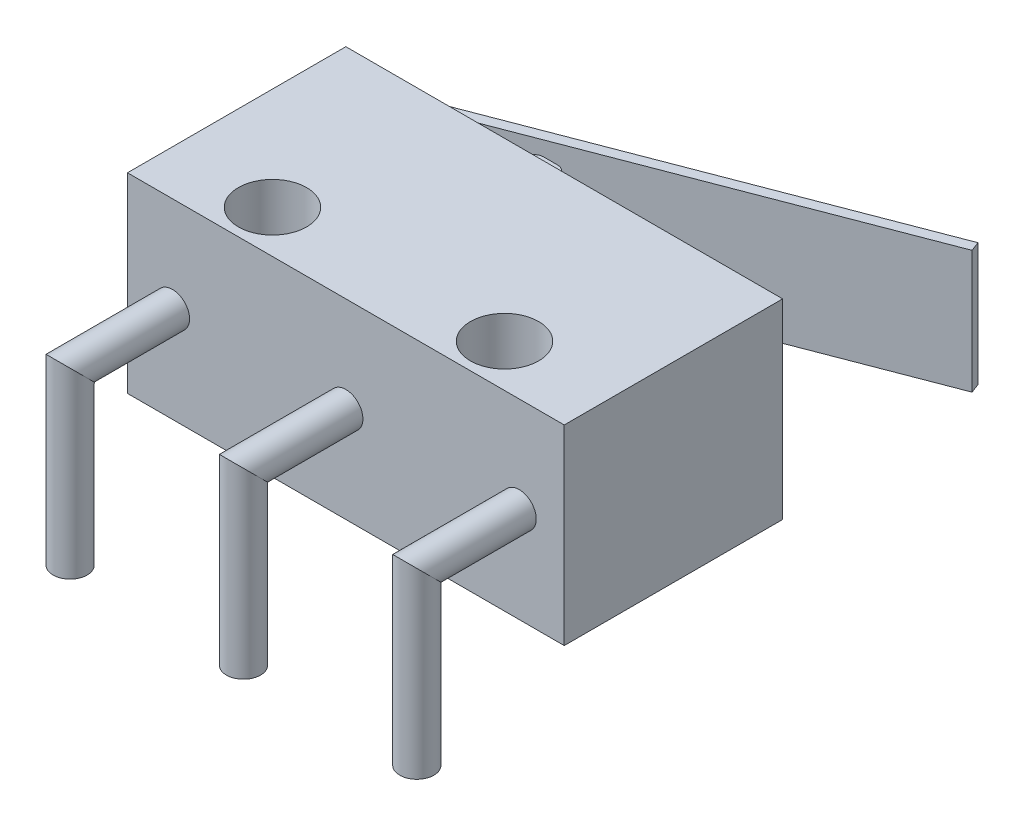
ISO-10303-21;
HEADER;
FILE_DESCRIPTION(('STEP AP214'),'2;1');
FILE_NAME('part.step','',(''),(''),'','','');
FILE_SCHEMA(('AUTOMOTIVE_DESIGN { 1 0 10303 214 1 1 1 1 }'));
ENDSEC;
DATA;
#1=APPLICATION_CONTEXT('core data for automotive mechanical design processes');
#2=APPLICATION_PROTOCOL_DEFINITION('international standard','automotive_design',2000,#1);
#3=PRODUCT_CONTEXT('',#1,'mechanical');
#4=PRODUCT('Part','Part','',(#3));
#5=PRODUCT_RELATED_PRODUCT_CATEGORY('part','',(#4));
#6=PRODUCT_DEFINITION_FORMATION('','',#4);
#7=PRODUCT_DEFINITION_CONTEXT('part definition',#1,'design');
#8=PRODUCT_DEFINITION('design','',#6,#7);
#9=PRODUCT_DEFINITION_SHAPE('','',#8);
#10=(LENGTH_UNIT() NAMED_UNIT(*) SI_UNIT(.MILLI.,.METRE.));
#11=(NAMED_UNIT(*) PLANE_ANGLE_UNIT() SI_UNIT($,.RADIAN.));
#12=(NAMED_UNIT(*) SI_UNIT($,.STERADIAN.) SOLID_ANGLE_UNIT());
#13=UNCERTAINTY_MEASURE_WITH_UNIT(LENGTH_MEASURE(1.E-05),#10,'distance_accuracy_value','');
#14=(GEOMETRIC_REPRESENTATION_CONTEXT(3) GLOBAL_UNCERTAINTY_ASSIGNED_CONTEXT((#13)) GLOBAL_UNIT_ASSIGNED_CONTEXT((#10,
#11,#12)) REPRESENTATION_CONTEXT('',''));
#15=CARTESIAN_POINT('',(0.,0.,0.));
#16=DIRECTION('',(0.,0.,1.));
#17=DIRECTION('',(1.,0.,0.));
#18=AXIS2_PLACEMENT_3D('',#15,#16,#17);
#19=CARTESIAN_POINT('',(0.,5.6,0.));
#20=DIRECTION('',(0.,0.,-1.));
#21=DIRECTION('',(-1.,0.,0.));
#22=AXIS2_PLACEMENT_3D('',#19,#20,#21);
#23=PLANE('',#22);
#24=CARTESIAN_POINT('',(1.32,2.8,0.));
#25=DIRECTION('',(0.,0.,1.));
#26=DIRECTION('',(1.,0.,0.));
#27=AXIS2_PLACEMENT_3D('',#24,#25,#26);
#28=CIRCLE('',#27,0.5);
#29=CARTESIAN_POINT('',(1.82,2.8,0.));
#30=VERTEX_POINT('',#29);
#31=EDGE_CURVE('E45',#30,#30,#28,.T.);
#32=ORIENTED_EDGE('',*,*,#31,.F.);
#33=EDGE_LOOP('',(#32));
#34=FACE_BOUND('',#33,.T.);
#35=DIRECTION('',(1.,0.,0.));
#36=VECTOR('',#35,1.);
#37=CARTESIAN_POINT('',(0.,0.,0.));
#38=LINE('',#37,#36);
#39=CARTESIAN_POINT('',(0.,0.,0.));
#40=VERTEX_POINT('',#39);
#41=CARTESIAN_POINT('',(12.8,0.,0.));
#42=VERTEX_POINT('',#41);
#43=EDGE_CURVE('E269',#40,#42,#38,.T.);
#44=ORIENTED_EDGE('',*,*,#43,.T.);
#45=DIRECTION('',(0.,-1.,0.));
#46=VECTOR('',#45,1.);
#47=CARTESIAN_POINT('',(12.8,5.6,0.));
#48=LINE('',#47,#46);
#49=CARTESIAN_POINT('',(12.8,5.6,0.));
#50=VERTEX_POINT('',#49);
#51=EDGE_CURVE('E290',#50,#42,#48,.T.);
#52=ORIENTED_EDGE('',*,*,#51,.F.);
#53=DIRECTION('',(1.,0.,0.));
#54=VECTOR('',#53,1.);
#55=CARTESIAN_POINT('',(0.,5.6,0.));
#56=LINE('',#55,#54);
#57=CARTESIAN_POINT('',(0.,5.6,0.));
#58=VERTEX_POINT('',#57);
#59=EDGE_CURVE('E278',#58,#50,#56,.T.);
#60=ORIENTED_EDGE('',*,*,#59,.F.);
#61=DIRECTION('',(0.,-1.,0.));
#62=VECTOR('',#61,1.);
#63=CARTESIAN_POINT('',(0.,5.6,0.));
#64=LINE('',#63,#62);
#65=EDGE_CURVE('E293',#58,#40,#64,.T.);
#66=ORIENTED_EDGE('',*,*,#65,.T.);
#67=EDGE_LOOP('',(#44,#52,#60,#66));
#68=FACE_BOUND('',#67,.T.);
#69=CARTESIAN_POINT('',(6.4,2.8,0.));
#70=DIRECTION('',(0.,0.,1.));
#71=DIRECTION('',(1.,0.,0.));
#72=AXIS2_PLACEMENT_3D('',#69,#70,#71);
#73=CIRCLE('',#72,0.500000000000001);
#74=CARTESIAN_POINT('',(6.9,2.8,0.));
#75=VERTEX_POINT('',#74);
#76=EDGE_CURVE('E314',#75,#75,#73,.T.);
#77=ORIENTED_EDGE('',*,*,#76,.F.);
#78=EDGE_LOOP('',(#77));
#79=FACE_BOUND('',#78,.T.);
#80=CARTESIAN_POINT('',(11.48,2.8,0.));
#81=DIRECTION('',(0.,0.,1.));
#82=DIRECTION('',(-1.,0.,0.));
#83=AXIS2_PLACEMENT_3D('',#80,#81,#82);
#84=CIRCLE('',#83,0.499999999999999);
#85=CARTESIAN_POINT('',(10.98,2.8,0.));
#86=VERTEX_POINT('',#85);
#87=EDGE_CURVE('E12',#86,#86,#84,.T.);
#88=ORIENTED_EDGE('',*,*,#87,.F.);
#89=EDGE_LOOP('',(#88));
#90=FACE_BOUND('',#89,.T.);
#91=ADVANCED_FACE('F36',(#34,#68,#79,#90),#23,.F.);
#92=CARTESIAN_POINT('',(0.,5.6,-6.4));
#93=DIRECTION('',(0.,0.,1.));
#94=DIRECTION('',(1.,0.,0.));
#95=AXIS2_PLACEMENT_3D('',#92,#93,#94);
#96=PLANE('',#95);
#97=DIRECTION('',(0.,1.,0.));
#98=VECTOR('',#97,1.);
#99=CARTESIAN_POINT('',(4.,1.4,-6.4));
#100=LINE('',#99,#98);
#101=CARTESIAN_POINT('',(4.,1.4,-6.4));
#102=VERTEX_POINT('',#101);
#103=CARTESIAN_POINT('',(4.,4.2,-6.4));
#104=VERTEX_POINT('',#103);
#105=EDGE_CURVE('E228',#102,#104,#100,.T.);
#106=ORIENTED_EDGE('',*,*,#105,.F.);
#107=DIRECTION('',(-1.,0.,0.));
#108=VECTOR('',#107,1.);
#109=CARTESIAN_POINT('',(4.,1.4,-6.4));
#110=LINE('',#109,#108);
#111=CARTESIAN_POINT('',(5.,1.4,-6.4));
#112=VERTEX_POINT('',#111);
#113=EDGE_CURVE('E237',#112,#102,#110,.T.);
#114=ORIENTED_EDGE('',*,*,#113,.F.);
#115=DIRECTION('',(0.,-1.,0.));
#116=VECTOR('',#115,1.);
#117=CARTESIAN_POINT('',(5.,1.4,-6.4));
#118=LINE('',#117,#116);
#119=CARTESIAN_POINT('',(5.,4.2,-6.4));
#120=VERTEX_POINT('',#119);
#121=EDGE_CURVE('E234',#120,#112,#118,.T.);
#122=ORIENTED_EDGE('',*,*,#121,.F.);
#123=DIRECTION('',(1.,0.,0.));
#124=VECTOR('',#123,1.);
#125=CARTESIAN_POINT('',(4.,4.2,-6.4));
#126=LINE('',#125,#124);
#127=EDGE_CURVE('E231',#104,#120,#126,.T.);
#128=ORIENTED_EDGE('',*,*,#127,.F.);
#129=EDGE_LOOP('',(#106,#114,#122,#128));
#130=FACE_BOUND('',#129,.T.);
#131=DIRECTION('',(-1.,0.,0.));
#132=VECTOR('',#131,1.);
#133=CARTESIAN_POINT('',(0.,0.,-6.4));
#134=LINE('',#133,#132);
#135=CARTESIAN_POINT('',(12.8,0.,-6.4));
#136=VERTEX_POINT('',#135);
#137=CARTESIAN_POINT('',(0.,0.,-6.4));
#138=VERTEX_POINT('',#137);
#139=EDGE_CURVE('E273',#136,#138,#134,.T.);
#140=ORIENTED_EDGE('',*,*,#139,.T.);
#141=DIRECTION('',(0.,-1.,0.));
#142=VECTOR('',#141,1.);
#143=CARTESIAN_POINT('',(0.,5.6,-6.4));
#144=LINE('',#143,#142);
#145=CARTESIAN_POINT('',(0.,5.6,-6.4));
#146=VERTEX_POINT('',#145);
#147=EDGE_CURVE('E284',#146,#138,#144,.T.);
#148=ORIENTED_EDGE('',*,*,#147,.F.);
#149=DIRECTION('',(-1.,0.,0.));
#150=VECTOR('',#149,1.);
#151=CARTESIAN_POINT('',(0.,5.6,-6.4));
#152=LINE('',#151,#150);
#153=CARTESIAN_POINT('',(12.8,5.6,-6.4));
#154=VERTEX_POINT('',#153);
#155=EDGE_CURVE('E282',#154,#146,#152,.T.);
#156=ORIENTED_EDGE('',*,*,#155,.F.);
#157=DIRECTION('',(0.,-1.,0.));
#158=VECTOR('',#157,1.);
#159=CARTESIAN_POINT('',(12.8,5.6,-6.4));
#160=LINE('',#159,#158);
#161=EDGE_CURVE('E287',#154,#136,#160,.T.);
#162=ORIENTED_EDGE('',*,*,#161,.T.);
#163=EDGE_LOOP('',(#140,#148,#156,#162));
#164=FACE_BOUND('',#163,.T.);
#165=DIRECTION('',(0.,-1.,0.));
#166=VECTOR('',#165,1.);
#167=CARTESIAN_POINT('',(1.3,4.6,-6.4));
#168=LINE('',#167,#166);
#169=CARTESIAN_POINT('',(1.3,4.6,-6.4));
#170=VERTEX_POINT('',#169);
#171=CARTESIAN_POINT('',(1.3,1.,-6.4));
#172=VERTEX_POINT('',#171);
#173=EDGE_CURVE('E175',#170,#172,#168,.T.);
#174=ORIENTED_EDGE('',*,*,#173,.F.);
#175=DIRECTION('',(1.,0.,0.));
#176=VECTOR('',#175,1.);
#177=CARTESIAN_POINT('',(1.3,4.6,-6.4));
#178=LINE('',#177,#176);
#179=CARTESIAN_POINT('',(0.999999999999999,4.6,-6.4));
#180=VERTEX_POINT('',#179);
#181=EDGE_CURVE('E53',#180,#170,#178,.T.);
#182=ORIENTED_EDGE('',*,*,#181,.F.);
#183=DIRECTION('',(0.,1.,0.));
#184=VECTOR('',#183,1.);
#185=CARTESIAN_POINT('',(0.999999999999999,4.6,-6.4));
#186=LINE('',#185,#184);
#187=CARTESIAN_POINT('',(0.999999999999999,1.,-6.4));
#188=VERTEX_POINT('',#187);
#189=EDGE_CURVE('E159',#188,#180,#186,.T.);
#190=ORIENTED_EDGE('',*,*,#189,.F.);
#191=DIRECTION('',(-1.,0.,0.));
#192=VECTOR('',#191,1.);
#193=CARTESIAN_POINT('',(1.3,1.,-6.4));
#194=LINE('',#193,#192);
#195=EDGE_CURVE('E58',#172,#188,#194,.T.);
#196=ORIENTED_EDGE('',*,*,#195,.F.);
#197=EDGE_LOOP('',(#174,#182,#190,#196));
#198=FACE_BOUND('',#197,.T.);
#199=ADVANCED_FACE('F160',(#130,#164,#198),#96,.F.);
#200=CARTESIAN_POINT('',(0.,5.6,-6.4));
#201=DIRECTION('',(0.,-1.,0.));
#202=DIRECTION('',(0.,0.,-1.));
#203=AXIS2_PLACEMENT_3D('',#200,#201,#202);
#204=PLANE('',#203);
#205=CARTESIAN_POINT('',(3.,5.6,-1.25));
#206=DIRECTION('',(0.,1.,0.));
#207=DIRECTION('',(0.,0.,1.));
#208=AXIS2_PLACEMENT_3D('',#205,#206,#207);
#209=CIRCLE('',#208,1.);
#210=CARTESIAN_POINT('',(3.,5.6,-0.25));
#211=VERTEX_POINT('',#210);
#212=EDGE_CURVE('E263',#211,#211,#209,.T.);
#213=ORIENTED_EDGE('',*,*,#212,.F.);
#214=EDGE_LOOP('',(#213));
#215=FACE_BOUND('',#214,.T.);
#216=DIRECTION('',(0.,0.,1.));
#217=VECTOR('',#216,1.);
#218=CARTESIAN_POINT('',(0.,5.6,0.));
#219=LINE('',#218,#217);
#220=EDGE_CURVE('E275',#146,#58,#219,.T.);
#221=ORIENTED_EDGE('',*,*,#220,.T.);
#222=ORIENTED_EDGE('',*,*,#59,.T.);
#223=DIRECTION('',(0.,0.,-1.));
#224=VECTOR('',#223,1.);
#225=CARTESIAN_POINT('',(12.8,5.6,0.));
#226=LINE('',#225,#224);
#227=EDGE_CURVE('E280',#50,#154,#226,.T.);
#228=ORIENTED_EDGE('',*,*,#227,.T.);
#229=ORIENTED_EDGE('',*,*,#155,.T.);
#230=EDGE_LOOP('',(#221,#222,#228,#229));
#231=FACE_BOUND('',#230,.T.);
#232=CARTESIAN_POINT('',(9.8,5.6,-1.25));
#233=DIRECTION('',(0.,1.,0.));
#234=DIRECTION('',(0.,0.,-1.));
#235=AXIS2_PLACEMENT_3D('',#232,#233,#234);
#236=CIRCLE('',#235,1.);
#237=CARTESIAN_POINT('',(9.8,5.6,-2.25));
#238=VERTEX_POINT('',#237);
#239=EDGE_CURVE('E257',#238,#238,#236,.T.);
#240=ORIENTED_EDGE('',*,*,#239,.F.);
#241=EDGE_LOOP('',(#240));
#242=FACE_BOUND('',#241,.T.);
#243=ADVANCED_FACE('F372',(#215,#231,#242),#204,.F.);
#244=CARTESIAN_POINT('',(0.,0.,-6.4));
#245=DIRECTION('',(0.,-1.,0.));
#246=DIRECTION('',(0.,0.,-1.));
#247=AXIS2_PLACEMENT_3D('',#244,#245,#246);
#248=PLANE('',#247);
#249=CARTESIAN_POINT('',(3.,0.,-1.25));
#250=DIRECTION('',(0.,1.,0.));
#251=DIRECTION('',(0.,0.,1.));
#252=AXIS2_PLACEMENT_3D('',#249,#250,#251);
#253=CIRCLE('',#252,1.);
#254=CARTESIAN_POINT('',(3.,0.,-0.25));
#255=VERTEX_POINT('',#254);
#256=EDGE_CURVE('E260',#255,#255,#253,.T.);
#257=ORIENTED_EDGE('',*,*,#256,.T.);
#258=EDGE_LOOP('',(#257));
#259=FACE_BOUND('',#258,.T.);
#260=DIRECTION('',(0.,0.,1.));
#261=VECTOR('',#260,1.);
#262=CARTESIAN_POINT('',(0.,0.,0.));
#263=LINE('',#262,#261);
#264=EDGE_CURVE('E266',#138,#40,#263,.T.);
#265=ORIENTED_EDGE('',*,*,#264,.F.);
#266=ORIENTED_EDGE('',*,*,#139,.F.);
#267=DIRECTION('',(0.,0.,-1.));
#268=VECTOR('',#267,1.);
#269=CARTESIAN_POINT('',(12.8,0.,0.));
#270=LINE('',#269,#268);
#271=EDGE_CURVE('E271',#42,#136,#270,.T.);
#272=ORIENTED_EDGE('',*,*,#271,.F.);
#273=ORIENTED_EDGE('',*,*,#43,.F.);
#274=EDGE_LOOP('',(#265,#266,#272,#273));
#275=FACE_BOUND('',#274,.T.);
#276=CARTESIAN_POINT('',(9.8,0.,-1.25));
#277=DIRECTION('',(0.,1.,0.));
#278=DIRECTION('',(0.,0.,-1.));
#279=AXIS2_PLACEMENT_3D('',#276,#277,#278);
#280=CIRCLE('',#279,1.);
#281=CARTESIAN_POINT('',(9.8,0.,-2.25));
#282=VERTEX_POINT('',#281);
#283=EDGE_CURVE('E254',#282,#282,#280,.T.);
#284=ORIENTED_EDGE('',*,*,#283,.T.);
#285=EDGE_LOOP('',(#284));
#286=FACE_BOUND('',#285,.T.);
#287=ADVANCED_FACE('F385',(#259,#275,#286),#248,.T.);
#288=CARTESIAN_POINT('',(0.,5.6,0.));
#289=DIRECTION('',(1.,0.,0.));
#290=DIRECTION('',(0.,0.,-1.));
#291=AXIS2_PLACEMENT_3D('',#288,#289,#290);
#292=PLANE('',#291);
#293=ORIENTED_EDGE('',*,*,#264,.T.);
#294=ORIENTED_EDGE('',*,*,#65,.F.);
#295=ORIENTED_EDGE('',*,*,#220,.F.);
#296=ORIENTED_EDGE('',*,*,#147,.T.);
#297=EDGE_LOOP('',(#293,#294,#295,#296));
#298=FACE_BOUND('',#297,.T.);
#299=ADVANCED_FACE('F38',(#298),#292,.F.);
#300=CARTESIAN_POINT('',(12.8,5.6,0.));
#301=DIRECTION('',(-1.,0.,0.));
#302=DIRECTION('',(0.,0.,1.));
#303=AXIS2_PLACEMENT_3D('',#300,#301,#302);
#304=PLANE('',#303);
#305=ORIENTED_EDGE('',*,*,#271,.T.);
#306=ORIENTED_EDGE('',*,*,#161,.F.);
#307=ORIENTED_EDGE('',*,*,#227,.F.);
#308=ORIENTED_EDGE('',*,*,#51,.T.);
#309=EDGE_LOOP('',(#305,#306,#307,#308));
#310=FACE_BOUND('',#309,.T.);
#311=ADVANCED_FACE('F378',(#310),#304,.F.);
#312=CARTESIAN_POINT('',(3.,5.6,-1.25));
#313=DIRECTION('',(0.,-1.,0.));
#314=DIRECTION('',(0.,0.,-1.));
#315=AXIS2_PLACEMENT_3D('',#312,#313,#314);
#316=CYLINDRICAL_SURFACE('',#315,1.);
#317=ORIENTED_EDGE('',*,*,#212,.T.);
#318=EDGE_LOOP('',(#317));
#319=FACE_BOUND('',#318,.T.);
#320=ORIENTED_EDGE('',*,*,#256,.F.);
#321=EDGE_LOOP('',(#320));
#322=FACE_BOUND('',#321,.T.);
#323=ADVANCED_FACE('F380',(#319,#322),#316,.F.);
#324=CARTESIAN_POINT('',(9.8,5.6,-1.25));
#325=DIRECTION('',(0.,-1.,0.));
#326=DIRECTION('',(0.,0.,-1.));
#327=AXIS2_PLACEMENT_3D('',#324,#325,#326);
#328=CYLINDRICAL_SURFACE('',#327,1.);
#329=ORIENTED_EDGE('',*,*,#239,.T.);
#330=EDGE_LOOP('',(#329));
#331=FACE_BOUND('',#330,.T.);
#332=ORIENTED_EDGE('',*,*,#283,.F.);
#333=EDGE_LOOP('',(#332));
#334=FACE_BOUND('',#333,.T.);
#335=ADVANCED_FACE('F392',(#331,#334),#328,.F.);
#336=CARTESIAN_POINT('',(4.,1.4,-7.9));
#337=DIRECTION('',(1.,0.,0.));
#338=DIRECTION('',(0.,0.,-1.));
#339=AXIS2_PLACEMENT_3D('',#336,#337,#338);
#340=PLANE('',#339);
#341=DIRECTION('',(0.,0.,1.));
#342=VECTOR('',#341,1.);
#343=CARTESIAN_POINT('',(4.,4.2,-7.9));
#344=LINE('',#343,#342);
#345=CARTESIAN_POINT('',(4.,4.2,-7.6));
#346=VERTEX_POINT('',#345);
#347=EDGE_CURVE('E252',#346,#104,#344,.T.);
#348=ORIENTED_EDGE('',*,*,#347,.F.);
#349=DIRECTION('',(0.,1.,0.));
#350=VECTOR('',#349,1.);
#351=CARTESIAN_POINT('',(4.,1.4,-7.6));
#352=LINE('',#351,#350);
#353=CARTESIAN_POINT('',(4.,1.4,-7.6));
#354=VERTEX_POINT('',#353);
#355=EDGE_CURVE('E40',#346,#354,#352,.F.);
#356=ORIENTED_EDGE('',*,*,#355,.T.);
#357=DIRECTION('',(0.,0.,1.));
#358=VECTOR('',#357,1.);
#359=CARTESIAN_POINT('',(4.,1.4,-7.9));
#360=LINE('',#359,#358);
#361=EDGE_CURVE('E246',#354,#102,#360,.T.);
#362=ORIENTED_EDGE('',*,*,#361,.T.);
#363=ORIENTED_EDGE('',*,*,#105,.T.);
#364=EDGE_LOOP('',(#348,#356,#362,#363));
#365=FACE_BOUND('',#364,.T.);
#366=ADVANCED_FACE('F396',(#365),#340,.F.);
#367=CARTESIAN_POINT('',(4.,4.2,-7.9));
#368=DIRECTION('',(0.,-1.,0.));
#369=DIRECTION('',(0.,0.,-1.));
#370=AXIS2_PLACEMENT_3D('',#367,#368,#369);
#371=PLANE('',#370);
#372=DIRECTION('',(0.,0.,1.));
#373=VECTOR('',#372,1.);
#374=CARTESIAN_POINT('',(5.,4.2,-7.9));
#375=LINE('',#374,#373);
#376=CARTESIAN_POINT('',(5.,4.2,-7.6));
#377=VERTEX_POINT('',#376);
#378=EDGE_CURVE('E250',#377,#120,#375,.T.);
#379=ORIENTED_EDGE('',*,*,#378,.F.);
#380=CARTESIAN_POINT('',(4.7,4.2,-7.6));
#381=DIRECTION('',(0.,-1.,0.));
#382=DIRECTION('',(0.,0.,-1.));
#383=AXIS2_PLACEMENT_3D('',#380,#381,#382);
#384=CIRCLE('',#383,0.3);
#385=CARTESIAN_POINT('',(4.7,4.2,-7.9));
#386=VERTEX_POINT('',#385);
#387=EDGE_CURVE('E309',#377,#386,#384,.F.);
#388=ORIENTED_EDGE('',*,*,#387,.T.);
#389=DIRECTION('',(1.,0.,0.));
#390=VECTOR('',#389,1.);
#391=CARTESIAN_POINT('',(4.,4.2,-7.9));
#392=LINE('',#391,#390);
#393=CARTESIAN_POINT('',(4.3,4.2,-7.9));
#394=VERTEX_POINT('',#393);
#395=EDGE_CURVE('E240',#394,#386,#392,.T.);
#396=ORIENTED_EDGE('',*,*,#395,.F.);
#397=CARTESIAN_POINT('',(4.3,4.2,-7.6));
#398=DIRECTION('',(0.,-1.,0.));
#399=DIRECTION('',(0.,0.,-1.));
#400=AXIS2_PLACEMENT_3D('',#397,#398,#399);
#401=CIRCLE('',#400,0.3);
#402=EDGE_CURVE('E308',#394,#346,#401,.F.);
#403=ORIENTED_EDGE('',*,*,#402,.T.);
#404=ORIENTED_EDGE('',*,*,#347,.T.);
#405=ORIENTED_EDGE('',*,*,#127,.T.);
#406=EDGE_LOOP('',(#379,#388,#396,#403,#404,#405));
#407=FACE_BOUND('',#406,.T.);
#408=ADVANCED_FACE('F400',(#407),#371,.F.);
#409=CARTESIAN_POINT('',(5.,1.4,-7.9));
#410=DIRECTION('',(-1.,0.,0.));
#411=DIRECTION('',(0.,0.,1.));
#412=AXIS2_PLACEMENT_3D('',#409,#410,#411);
#413=PLANE('',#412);
#414=DIRECTION('',(0.,0.,1.));
#415=VECTOR('',#414,1.);
#416=CARTESIAN_POINT('',(5.,1.4,-7.9));
#417=LINE('',#416,#415);
#418=CARTESIAN_POINT('',(5.,1.4,-7.6));
#419=VERTEX_POINT('',#418);
#420=EDGE_CURVE('E248',#419,#112,#417,.T.);
#421=ORIENTED_EDGE('',*,*,#420,.F.);
#422=DIRECTION('',(0.,-1.,0.));
#423=VECTOR('',#422,1.);
#424=CARTESIAN_POINT('',(5.,4.2,-7.6));
#425=LINE('',#424,#423);
#426=EDGE_CURVE('E306',#419,#377,#425,.F.);
#427=ORIENTED_EDGE('',*,*,#426,.T.);
#428=ORIENTED_EDGE('',*,*,#378,.T.);
#429=ORIENTED_EDGE('',*,*,#121,.T.);
#430=EDGE_LOOP('',(#421,#427,#428,#429));
#431=FACE_BOUND('',#430,.T.);
#432=ADVANCED_FACE('F403',(#431),#413,.F.);
#433=CARTESIAN_POINT('',(4.,1.4,-7.9));
#434=DIRECTION('',(0.,1.,0.));
#435=DIRECTION('',(0.,0.,1.));
#436=AXIS2_PLACEMENT_3D('',#433,#434,#435);
#437=PLANE('',#436);
#438=DIRECTION('',(-1.,0.,0.));
#439=VECTOR('',#438,1.);
#440=CARTESIAN_POINT('',(4.,1.4,-7.9));
#441=LINE('',#440,#439);
#442=CARTESIAN_POINT('',(4.7,1.4,-7.9));
#443=VERTEX_POINT('',#442);
#444=CARTESIAN_POINT('',(4.3,1.4,-7.9));
#445=VERTEX_POINT('',#444);
#446=EDGE_CURVE('E243',#443,#445,#441,.T.);
#447=ORIENTED_EDGE('',*,*,#446,.F.);
#448=CARTESIAN_POINT('',(4.7,1.4,-7.6));
#449=DIRECTION('',(0.,1.,0.));
#450=DIRECTION('',(0.,0.,1.));
#451=AXIS2_PLACEMENT_3D('',#448,#449,#450);
#452=CIRCLE('',#451,0.3);
#453=EDGE_CURVE('E304',#443,#419,#452,.F.);
#454=ORIENTED_EDGE('',*,*,#453,.T.);
#455=ORIENTED_EDGE('',*,*,#420,.T.);
#456=ORIENTED_EDGE('',*,*,#113,.T.);
#457=ORIENTED_EDGE('',*,*,#361,.F.);
#458=CARTESIAN_POINT('',(4.3,1.4,-7.6));
#459=DIRECTION('',(0.,1.,0.));
#460=DIRECTION('',(0.,0.,1.));
#461=AXIS2_PLACEMENT_3D('',#458,#459,#460);
#462=CIRCLE('',#461,0.3);
#463=EDGE_CURVE('E302',#354,#445,#462,.F.);
#464=ORIENTED_EDGE('',*,*,#463,.T.);
#465=EDGE_LOOP('',(#447,#454,#455,#456,#457,#464));
#466=FACE_BOUND('',#465,.T.);
#467=ADVANCED_FACE('F406',(#466),#437,.F.);
#468=CARTESIAN_POINT('',(4.,4.2,-7.9));
#469=DIRECTION('',(0.,0.,-1.));
#470=DIRECTION('',(-1.,0.,0.));
#471=AXIS2_PLACEMENT_3D('',#468,#469,#470);
#472=PLANE('',#471);
#473=ORIENTED_EDGE('',*,*,#395,.T.);
#474=DIRECTION('',(0.,-1.,0.));
#475=VECTOR('',#474,1.);
#476=CARTESIAN_POINT('',(4.7,1.4,-7.9));
#477=LINE('',#476,#475);
#478=EDGE_CURVE('E299',#386,#443,#477,.T.);
#479=ORIENTED_EDGE('',*,*,#478,.T.);
#480=ORIENTED_EDGE('',*,*,#446,.T.);
#481=DIRECTION('',(0.,1.,0.));
#482=VECTOR('',#481,1.);
#483=CARTESIAN_POINT('',(4.3,4.2,-7.9));
#484=LINE('',#483,#482);
#485=EDGE_CURVE('E296',#445,#394,#484,.T.);
#486=ORIENTED_EDGE('',*,*,#485,.T.);
#487=EDGE_LOOP('',(#473,#479,#480,#486));
#488=FACE_BOUND('',#487,.T.);
#489=ADVANCED_FACE('F410',(#488),#472,.T.);
#490=CARTESIAN_POINT('',(4.7,4.2,-7.6));
#491=DIRECTION('',(0.,1.,0.));
#492=DIRECTION('',(0.,0.,1.));
#493=AXIS2_PLACEMENT_3D('',#490,#491,#492);
#494=CYLINDRICAL_SURFACE('',#493,0.3);
#495=ORIENTED_EDGE('',*,*,#387,.F.);
#496=ORIENTED_EDGE('',*,*,#426,.F.);
#497=ORIENTED_EDGE('',*,*,#453,.F.);
#498=ORIENTED_EDGE('',*,*,#478,.F.);
#499=EDGE_LOOP('',(#495,#496,#497,#498));
#500=FACE_BOUND('',#499,.T.);
#501=ADVANCED_FACE('F414',(#500),#494,.T.);
#502=CARTESIAN_POINT('',(4.3,4.2,-7.6));
#503=DIRECTION('',(0.,-1.,0.));
#504=DIRECTION('',(0.,0.,-1.));
#505=AXIS2_PLACEMENT_3D('',#502,#503,#504);
#506=CYLINDRICAL_SURFACE('',#505,0.3);
#507=ORIENTED_EDGE('',*,*,#463,.F.);
#508=ORIENTED_EDGE('',*,*,#355,.F.);
#509=ORIENTED_EDGE('',*,*,#402,.F.);
#510=ORIENTED_EDGE('',*,*,#485,.F.);
#511=EDGE_LOOP('',(#507,#508,#509,#510));
#512=FACE_BOUND('',#511,.T.);
#513=ADVANCED_FACE('F418',(#512),#506,.T.);
#514=CARTESIAN_POINT('',(1.2569879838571,4.6,-7.1015752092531));
#515=DIRECTION('',(-0.357530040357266,0.,-0.933901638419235));
#516=DIRECTION('',(-0.933901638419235,0.,0.357530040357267));
#517=AXIS2_PLACEMENT_3D('',#514,#515,#516);
#518=PLANE('',#517);
#519=DIRECTION('',(0.,1.,0.));
#520=VECTOR('',#519,1.);
#521=CARTESIAN_POINT('',(1.2569879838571,4.6,-7.1015752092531));
#522=LINE('',#521,#520);
#523=CARTESIAN_POINT('',(1.2569879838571,1.,-7.1015752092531));
#524=VERTEX_POINT('',#523);
#525=CARTESIAN_POINT('',(1.2569879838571,4.6,-7.1015752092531));
#526=VERTEX_POINT('',#525);
#527=EDGE_CURVE('E190',#524,#526,#522,.T.);
#528=ORIENTED_EDGE('',*,*,#527,.T.);
#529=DIRECTION('',(0.933901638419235,0.,-0.357530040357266));
#530=VECTOR('',#529,1.);
#531=CARTESIAN_POINT('',(1.2569879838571,4.6,-7.1015752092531));
#532=LINE('',#531,#530);
#533=CARTESIAN_POINT('',(13.2370917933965,4.6,-11.6879757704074));
#534=VERTEX_POINT('',#533);
#535=EDGE_CURVE('E219',#526,#534,#532,.T.);
#536=ORIENTED_EDGE('',*,*,#535,.T.);
#537=DIRECTION('',(0.,1.,0.));
#538=VECTOR('',#537,1.);
#539=CARTESIAN_POINT('',(13.2370917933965,4.6,-11.6879757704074));
#540=LINE('',#539,#538);
#541=CARTESIAN_POINT('',(13.2370917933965,1.,-11.6879757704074));
#542=VERTEX_POINT('',#541);
#543=EDGE_CURVE('E210',#542,#534,#540,.T.);
#544=ORIENTED_EDGE('',*,*,#543,.F.);
#545=DIRECTION('',(0.933901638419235,0.,-0.357530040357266));
#546=VECTOR('',#545,1.);
#547=CARTESIAN_POINT('',(1.2569879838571,1.,-7.1015752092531));
#548=LINE('',#547,#546);
#549=EDGE_CURVE('E222',#524,#542,#548,.T.);
#550=ORIENTED_EDGE('',*,*,#549,.F.);
#551=EDGE_LOOP('',(#528,#536,#544,#550));
#552=FACE_BOUND('',#551,.T.);
#553=ADVANCED_FACE('F351',(#552),#518,.T.);
#554=CARTESIAN_POINT('',(1.36424699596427,4.6,-6.82140471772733));
#555=DIRECTION('',(0.357530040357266,0.,0.933901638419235));
#556=DIRECTION('',(0.933901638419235,0.,-0.357530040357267));
#557=AXIS2_PLACEMENT_3D('',#554,#555,#556);
#558=PLANE('',#557);
#559=DIRECTION('',(0.,-1.,0.));
#560=VECTOR('',#559,1.);
#561=CARTESIAN_POINT('',(1.36424699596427,4.6,-6.82140471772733));
#562=LINE('',#561,#560);
#563=CARTESIAN_POINT('',(1.36424699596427,4.6,-6.82140471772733));
#564=VERTEX_POINT('',#563);
#565=CARTESIAN_POINT('',(1.36424699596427,1.,-6.82140471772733));
#566=VERTEX_POINT('',#565);
#567=EDGE_CURVE('E182',#564,#566,#562,.T.);
#568=ORIENTED_EDGE('',*,*,#567,.T.);
#569=DIRECTION('',(0.933901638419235,0.,-0.357530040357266));
#570=VECTOR('',#569,1.);
#571=CARTESIAN_POINT('',(1.36424699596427,1.,-6.82140471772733));
#572=LINE('',#571,#570);
#573=CARTESIAN_POINT('',(13.3443508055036,1.,-11.4078052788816));
#574=VERTEX_POINT('',#573);
#575=EDGE_CURVE('E225',#566,#574,#572,.T.);
#576=ORIENTED_EDGE('',*,*,#575,.T.);
#577=DIRECTION('',(0.,-1.,0.));
#578=VECTOR('',#577,1.);
#579=CARTESIAN_POINT('',(13.3443508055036,4.6,-11.4078052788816));
#580=LINE('',#579,#578);
#581=CARTESIAN_POINT('',(13.3443508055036,4.6,-11.4078052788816));
#582=VERTEX_POINT('',#581);
#583=EDGE_CURVE('E204',#582,#574,#580,.T.);
#584=ORIENTED_EDGE('',*,*,#583,.F.);
#585=DIRECTION('',(0.933901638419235,0.,-0.357530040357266));
#586=VECTOR('',#585,1.);
#587=CARTESIAN_POINT('',(1.36424699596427,4.6,-6.82140471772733));
#588=LINE('',#587,#586);
#589=EDGE_CURVE('E216',#564,#582,#588,.T.);
#590=ORIENTED_EDGE('',*,*,#589,.F.);
#591=EDGE_LOOP('',(#568,#576,#584,#590));
#592=FACE_BOUND('',#591,.T.);
#593=ADVANCED_FACE('F355',(#592),#558,.T.);
#594=CARTESIAN_POINT('',(1.4,2.8,-6.72801455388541));
#595=DIRECTION('',(0.,-1.,0.));
#596=DIRECTION('',(0.,0.,-1.));
#597=AXIS2_PLACEMENT_3D('',#594,#595,#596);
#598=CYLINDRICAL_SURFACE('',#597,0.400000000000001);
#599=DIRECTION('',(0.,1.,0.));
#600=VECTOR('',#599,1.);
#601=CARTESIAN_POINT('',(1.,4.6,-6.7280145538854));
#602=LINE('',#601,#600);
#603=CARTESIAN_POINT('',(1.,1.,-6.7280145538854));
#604=VERTEX_POINT('',#603);
#605=CARTESIAN_POINT('',(1.,4.6,-6.7280145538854));
#606=VERTEX_POINT('',#605);
#607=EDGE_CURVE('E179',#604,#606,#602,.T.);
#608=ORIENTED_EDGE('',*,*,#607,.T.);
#609=CARTESIAN_POINT('',(1.4,4.6,-6.72801455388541));
#610=DIRECTION('',(0.,-1.,0.));
#611=DIRECTION('',(0.,0.,-1.));
#612=AXIS2_PLACEMENT_3D('',#609,#610,#611);
#613=CIRCLE('',#612,0.400000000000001);
#614=EDGE_CURVE('E196',#606,#526,#613,.T.);
#615=ORIENTED_EDGE('',*,*,#614,.T.);
#616=ORIENTED_EDGE('',*,*,#527,.F.);
#617=CARTESIAN_POINT('',(1.4,1.,-6.72801455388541));
#618=DIRECTION('',(0.,-1.,0.));
#619=DIRECTION('',(0.,0.,-1.));
#620=AXIS2_PLACEMENT_3D('',#617,#618,#619);
#621=CIRCLE('',#620,0.400000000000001);
#622=EDGE_CURVE('E199',#604,#524,#621,.T.);
#623=ORIENTED_EDGE('',*,*,#622,.F.);
#624=EDGE_LOOP('',(#608,#615,#616,#623));
#625=FACE_BOUND('',#624,.T.);
#626=ADVANCED_FACE('F349',(#625),#598,.T.);
#627=CARTESIAN_POINT('',(1.4,2.8,-6.72801455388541));
#628=DIRECTION('',(0.,-1.,0.));
#629=DIRECTION('',(0.,0.,-1.));
#630=AXIS2_PLACEMENT_3D('',#627,#628,#629);
#631=CYLINDRICAL_SURFACE('',#630,0.1);
#632=DIRECTION('',(0.,-1.,0.));
#633=VECTOR('',#632,1.);
#634=CARTESIAN_POINT('',(1.3,4.6,-6.7280145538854));
#635=LINE('',#634,#633);
#636=CARTESIAN_POINT('',(1.3,4.6,-6.7280145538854));
#637=VERTEX_POINT('',#636);
#638=CARTESIAN_POINT('',(1.3,1.,-6.7280145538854));
#639=VERTEX_POINT('',#638);
#640=EDGE_CURVE('E337',#637,#639,#635,.T.);
#641=ORIENTED_EDGE('',*,*,#640,.T.);
#642=CARTESIAN_POINT('',(1.4,1.,-6.72801455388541));
#643=DIRECTION('',(0.,-1.,0.));
#644=DIRECTION('',(0.,0.,-1.));
#645=AXIS2_PLACEMENT_3D('',#642,#643,#644);
#646=CIRCLE('',#645,0.1);
#647=EDGE_CURVE('E201',#639,#566,#646,.T.);
#648=ORIENTED_EDGE('',*,*,#647,.T.);
#649=ORIENTED_EDGE('',*,*,#567,.F.);
#650=CARTESIAN_POINT('',(1.4,4.6,-6.72801455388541));
#651=DIRECTION('',(0.,-1.,0.));
#652=DIRECTION('',(0.,0.,-1.));
#653=AXIS2_PLACEMENT_3D('',#650,#651,#652);
#654=CIRCLE('',#653,0.1);
#655=EDGE_CURVE('E193',#637,#564,#654,.T.);
#656=ORIENTED_EDGE('',*,*,#655,.F.);
#657=EDGE_LOOP('',(#641,#648,#649,#656));
#658=FACE_BOUND('',#657,.T.);
#659=ADVANCED_FACE('F358',(#658),#631,.F.);
#660=CARTESIAN_POINT('',(1.3,4.6,-6.7280145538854));
#661=DIRECTION('',(-1.,0.,0.));
#662=DIRECTION('',(0.,0.,1.));
#663=AXIS2_PLACEMENT_3D('',#660,#661,#662);
#664=PLANE('',#663);
#665=ORIENTED_EDGE('',*,*,#173,.T.);
#666=DIRECTION('',(0.,0.,1.));
#667=VECTOR('',#666,1.);
#668=CARTESIAN_POINT('',(1.3,1.,-6.7280145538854));
#669=LINE('',#668,#667);
#670=EDGE_CURVE('E173',#639,#172,#669,.T.);
#671=ORIENTED_EDGE('',*,*,#670,.F.);
#672=ORIENTED_EDGE('',*,*,#640,.F.);
#673=DIRECTION('',(0.,0.,1.));
#674=VECTOR('',#673,1.);
#675=CARTESIAN_POINT('',(1.3,4.6,-6.7280145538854));
#676=LINE('',#675,#674);
#677=EDGE_CURVE('E184',#637,#170,#676,.T.);
#678=ORIENTED_EDGE('',*,*,#677,.T.);
#679=EDGE_LOOP('',(#665,#671,#672,#678));
#680=FACE_BOUND('',#679,.T.);
#681=ADVANCED_FACE('F344',(#680),#664,.F.);
#682=CARTESIAN_POINT('',(1.3,1.,-6.7280145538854));
#683=DIRECTION('',(0.,1.,0.));
#684=DIRECTION('',(0.,0.,1.));
#685=AXIS2_PLACEMENT_3D('',#682,#683,#684);
#686=PLANE('',#685);
#687=ORIENTED_EDGE('',*,*,#195,.T.);
#688=DIRECTION('',(0.,0.,1.));
#689=VECTOR('',#688,1.);
#690=CARTESIAN_POINT('',(1.,1.,-6.7280145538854));
#691=LINE('',#690,#689);
#692=EDGE_CURVE('E170',#604,#188,#691,.T.);
#693=ORIENTED_EDGE('',*,*,#692,.F.);
#694=ORIENTED_EDGE('',*,*,#622,.T.);
#695=ORIENTED_EDGE('',*,*,#549,.T.);
#696=DIRECTION('',(-0.357530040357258,0.,-0.933901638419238));
#697=VECTOR('',#696,1.);
#698=CARTESIAN_POINT('',(13.3443508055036,1.,-11.4078052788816));
#699=LINE('',#698,#697);
#700=EDGE_CURVE('E213',#574,#542,#699,.T.);
#701=ORIENTED_EDGE('',*,*,#700,.F.);
#702=ORIENTED_EDGE('',*,*,#575,.F.);
#703=ORIENTED_EDGE('',*,*,#647,.F.);
#704=ORIENTED_EDGE('',*,*,#670,.T.);
#705=EDGE_LOOP('',(#687,#693,#694,#695,#701,#702,#703,#704));
#706=FACE_BOUND('',#705,.T.);
#707=ADVANCED_FACE('F168',(#706),#686,.F.);
#708=CARTESIAN_POINT('',(1.,4.6,-6.7280145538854));
#709=DIRECTION('',(1.,0.,0.));
#710=DIRECTION('',(0.,0.,-1.));
#711=AXIS2_PLACEMENT_3D('',#708,#709,#710);
#712=PLANE('',#711);
#713=ORIENTED_EDGE('',*,*,#189,.T.);
#714=DIRECTION('',(0.,0.,1.));
#715=VECTOR('',#714,1.);
#716=CARTESIAN_POINT('',(1.,4.6,-6.7280145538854));
#717=LINE('',#716,#715);
#718=EDGE_CURVE('E180',#606,#180,#717,.T.);
#719=ORIENTED_EDGE('',*,*,#718,.F.);
#720=ORIENTED_EDGE('',*,*,#607,.F.);
#721=ORIENTED_EDGE('',*,*,#692,.T.);
#722=EDGE_LOOP('',(#713,#719,#720,#721));
#723=FACE_BOUND('',#722,.T.);
#724=ADVANCED_FACE('F177',(#723),#712,.F.);
#725=CARTESIAN_POINT('',(1.3,4.6,-6.7280145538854));
#726=DIRECTION('',(0.,-1.,0.));
#727=DIRECTION('',(0.,0.,-1.));
#728=AXIS2_PLACEMENT_3D('',#725,#726,#727);
#729=PLANE('',#728);
#730=ORIENTED_EDGE('',*,*,#181,.T.);
#731=ORIENTED_EDGE('',*,*,#677,.F.);
#732=ORIENTED_EDGE('',*,*,#655,.T.);
#733=ORIENTED_EDGE('',*,*,#589,.T.);
#734=DIRECTION('',(0.357530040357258,0.,0.933901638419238));
#735=VECTOR('',#734,1.);
#736=CARTESIAN_POINT('',(13.3443508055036,4.6,-11.4078052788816));
#737=LINE('',#736,#735);
#738=EDGE_CURVE('E207',#534,#582,#737,.T.);
#739=ORIENTED_EDGE('',*,*,#738,.F.);
#740=ORIENTED_EDGE('',*,*,#535,.F.);
#741=ORIENTED_EDGE('',*,*,#614,.F.);
#742=ORIENTED_EDGE('',*,*,#718,.T.);
#743=EDGE_LOOP('',(#730,#731,#732,#733,#739,#740,#741,#742));
#744=FACE_BOUND('',#743,.T.);
#745=ADVANCED_FACE('F346',(#744),#729,.F.);
#746=CARTESIAN_POINT('',(13.3443508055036,1.,-11.4078052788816));
#747=DIRECTION('',(0.933901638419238,0.,-0.357530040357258));
#748=DIRECTION('',(-0.357530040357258,0.,-0.933901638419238));
#749=AXIS2_PLACEMENT_3D('',#746,#747,#748);
#750=PLANE('',#749);
#751=ORIENTED_EDGE('',*,*,#583,.T.);
#752=ORIENTED_EDGE('',*,*,#700,.T.);
#753=ORIENTED_EDGE('',*,*,#543,.T.);
#754=ORIENTED_EDGE('',*,*,#738,.T.);
#755=EDGE_LOOP('',(#751,#752,#753,#754));
#756=FACE_BOUND('',#755,.T.);
#757=ADVANCED_FACE('F353',(#756),#750,.T.);
#758=CARTESIAN_POINT('',(6.4,2.8,3.));
#759=DIRECTION('',(0.,-1.,0.));
#760=DIRECTION('',(0.,0.,-1.));
#761=AXIS2_PLACEMENT_3D('',#758,#759,#760);
#762=CYLINDRICAL_SURFACE('',#761,0.500000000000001);
#763=CARTESIAN_POINT('',(6.4,2.8,3.));
#764=DIRECTION('',(0.,-0.707106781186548,0.707106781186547));
#765=DIRECTION('',(0.,-0.707106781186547,-0.707106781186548));
#766=AXIS2_PLACEMENT_3D('',#763,#764,#765);
#767=ELLIPSE('',#766,0.707106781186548,0.500000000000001);
#768=CARTESIAN_POINT('',(6.4,2.3,2.5));
#769=VERTEX_POINT('',#768);
#770=EDGE_CURVE('E329',#769,#769,#767,.T.);
#771=ORIENTED_EDGE('',*,*,#770,.T.);
#772=EDGE_LOOP('',(#771));
#773=FACE_BOUND('',#772,.T.);
#774=CARTESIAN_POINT('',(6.4,-2.2,3.));
#775=DIRECTION('',(0.,-1.,0.));
#776=DIRECTION('',(0.,0.,-1.));
#777=AXIS2_PLACEMENT_3D('',#774,#775,#776);
#778=CIRCLE('',#777,0.500000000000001);
#779=CARTESIAN_POINT('',(6.4,-2.2,2.5));
#780=VERTEX_POINT('',#779);
#781=EDGE_CURVE('E332',#780,#780,#778,.F.);
#782=ORIENTED_EDGE('',*,*,#781,.T.);
#783=EDGE_LOOP('',(#782));
#784=FACE_BOUND('',#783,.T.);
#785=ADVANCED_FACE('F480',(#773,#784),#762,.T.);
#786=CARTESIAN_POINT('',(6.4,2.8,4.4142135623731));
#787=DIRECTION('',(0.,0.,-1.));
#788=DIRECTION('',(-1.,0.,0.));
#789=AXIS2_PLACEMENT_3D('',#786,#787,#788);
#790=CYLINDRICAL_SURFACE('',#789,0.500000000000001);
#791=ORIENTED_EDGE('',*,*,#76,.T.);
#792=EDGE_LOOP('',(#791));
#793=FACE_BOUND('',#792,.T.);
#794=ORIENTED_EDGE('',*,*,#770,.F.);
#795=EDGE_LOOP('',(#794));
#796=FACE_BOUND('',#795,.T.);
#797=ADVANCED_FACE('F494',(#793,#796),#790,.T.);
#798=CARTESIAN_POINT('',(6.4,-2.2,3.));
#799=DIRECTION('',(0.,-1.,0.));
#800=DIRECTION('',(0.,0.,-1.));
#801=AXIS2_PLACEMENT_3D('',#798,#799,#800);
#802=PLANE('',#801);
#803=ORIENTED_EDGE('',*,*,#781,.F.);
#804=EDGE_LOOP('',(#803));
#805=FACE_BOUND('',#804,.T.);
#806=ADVANCED_FACE('F504',(#805),#802,.T.);
#807=CARTESIAN_POINT('',(1.32,2.8,3.));
#808=DIRECTION('',(0.,-1.,0.));
#809=DIRECTION('',(0.,0.,-1.));
#810=AXIS2_PLACEMENT_3D('',#807,#808,#809);
#811=CYLINDRICAL_SURFACE('',#810,0.5);
#812=CARTESIAN_POINT('',(1.32,2.8,3.));
#813=DIRECTION('',(0.,-0.707106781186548,0.707106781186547));
#814=DIRECTION('',(0.,-0.707106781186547,-0.707106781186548));
#815=AXIS2_PLACEMENT_3D('',#812,#813,#814);
#816=ELLIPSE('',#815,0.707106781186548,0.5);
#817=CARTESIAN_POINT('',(1.32,2.3,2.5));
#818=VERTEX_POINT('',#817);
#819=EDGE_CURVE('E581',#818,#818,#816,.T.);
#820=ORIENTED_EDGE('',*,*,#819,.T.);
#821=EDGE_LOOP('',(#820));
#822=FACE_BOUND('',#821,.T.);
#823=CARTESIAN_POINT('',(1.32,-2.2,3.));
#824=DIRECTION('',(0.,-1.,0.));
#825=DIRECTION('',(0.,0.,-1.));
#826=AXIS2_PLACEMENT_3D('',#823,#824,#825);
#827=CIRCLE('',#826,0.5);
#828=CARTESIAN_POINT('',(1.32,-2.2,2.5));
#829=VERTEX_POINT('',#828);
#830=EDGE_CURVE('E327',#829,#829,#827,.F.);
#831=ORIENTED_EDGE('',*,*,#830,.T.);
#832=EDGE_LOOP('',(#831));
#833=FACE_BOUND('',#832,.T.);
#834=ADVANCED_FACE('F513',(#822,#833),#811,.T.);
#835=CARTESIAN_POINT('',(1.32,2.8,4.41421356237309));
#836=DIRECTION('',(0.,0.,-1.));
#837=DIRECTION('',(-1.,0.,0.));
#838=AXIS2_PLACEMENT_3D('',#835,#836,#837);
#839=CYLINDRICAL_SURFACE('',#838,0.5);
#840=ORIENTED_EDGE('',*,*,#31,.T.);
#841=EDGE_LOOP('',(#840));
#842=FACE_BOUND('',#841,.T.);
#843=ORIENTED_EDGE('',*,*,#819,.F.);
#844=EDGE_LOOP('',(#843));
#845=FACE_BOUND('',#844,.T.);
#846=ADVANCED_FACE('F523',(#842,#845),#839,.T.);
#847=CARTESIAN_POINT('',(1.32,-2.2,3.));
#848=DIRECTION('',(0.,-1.,0.));
#849=DIRECTION('',(0.,0.,-1.));
#850=AXIS2_PLACEMENT_3D('',#847,#848,#849);
#851=PLANE('',#850);
#852=ORIENTED_EDGE('',*,*,#830,.F.);
#853=EDGE_LOOP('',(#852));
#854=FACE_BOUND('',#853,.T.);
#855=ADVANCED_FACE('F533',(#854),#851,.T.);
#856=CARTESIAN_POINT('',(11.48,2.8,3.));
#857=DIRECTION('',(0.,-1.,0.));
#858=DIRECTION('',(0.,0.,-1.));
#859=AXIS2_PLACEMENT_3D('',#856,#857,#858);
#860=CYLINDRICAL_SURFACE('',#859,0.499999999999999);
#861=CARTESIAN_POINT('',(11.48,2.8,3.));
#862=DIRECTION('',(0.,-0.707106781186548,0.707106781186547));
#863=DIRECTION('',(0.,-0.707106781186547,-0.707106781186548));
#864=AXIS2_PLACEMENT_3D('',#861,#862,#863);
#865=ELLIPSE('',#864,0.707106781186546,0.499999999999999);
#866=CARTESIAN_POINT('',(11.48,2.3,2.5));
#867=VERTEX_POINT('',#866);
#868=EDGE_CURVE('E582',#867,#867,#865,.T.);
#869=ORIENTED_EDGE('',*,*,#868,.T.);
#870=EDGE_LOOP('',(#869));
#871=FACE_BOUND('',#870,.T.);
#872=CARTESIAN_POINT('',(11.48,-2.2,3.));
#873=DIRECTION('',(0.,-1.,0.));
#874=DIRECTION('',(0.,0.,-1.));
#875=AXIS2_PLACEMENT_3D('',#872,#873,#874);
#876=CIRCLE('',#875,0.499999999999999);
#877=CARTESIAN_POINT('',(11.48,-2.2,2.5));
#878=VERTEX_POINT('',#877);
#879=EDGE_CURVE('E579',#878,#878,#876,.F.);
#880=ORIENTED_EDGE('',*,*,#879,.T.);
#881=EDGE_LOOP('',(#880));
#882=FACE_BOUND('',#881,.T.);
#883=ADVANCED_FACE('F543',(#871,#882),#860,.T.);
#884=CARTESIAN_POINT('',(11.48,2.8,4.41421356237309));
#885=DIRECTION('',(0.,0.,-1.));
#886=DIRECTION('',(-1.,0.,0.));
#887=AXIS2_PLACEMENT_3D('',#884,#885,#886);
#888=CYLINDRICAL_SURFACE('',#887,0.499999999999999);
#889=ORIENTED_EDGE('',*,*,#87,.T.);
#890=EDGE_LOOP('',(#889));
#891=FACE_BOUND('',#890,.T.);
#892=ORIENTED_EDGE('',*,*,#868,.F.);
#893=EDGE_LOOP('',(#892));
#894=FACE_BOUND('',#893,.T.);
#895=ADVANCED_FACE('F553',(#891,#894),#888,.T.);
#896=CARTESIAN_POINT('',(11.48,-2.2,3.));
#897=DIRECTION('',(0.,-1.,0.));
#898=DIRECTION('',(0.,0.,-1.));
#899=AXIS2_PLACEMENT_3D('',#896,#897,#898);
#900=PLANE('',#899);
#901=ORIENTED_EDGE('',*,*,#879,.F.);
#902=EDGE_LOOP('',(#901));
#903=FACE_BOUND('',#902,.T.);
#904=ADVANCED_FACE('F563',(#903),#900,.T.);
#905=CLOSED_SHELL('',(#91,#199,#243,#287,#299,#311,#323,#335,#366,#408,#432,#467,#489,#501,#513,
#553,#593,#626,#659,#681,#707,#724,#745,#757,#785,#797,#806,#834,#846,#855,#883,#895,#904));
#906=MANIFOLD_SOLID_BREP('B2',#905);
#907=ADVANCED_BREP_SHAPE_REPRESENTATION('',(#18,#906),#14);
#908=SHAPE_DEFINITION_REPRESENTATION(#9,#907);
ENDSEC;
END-ISO-10303-21;
